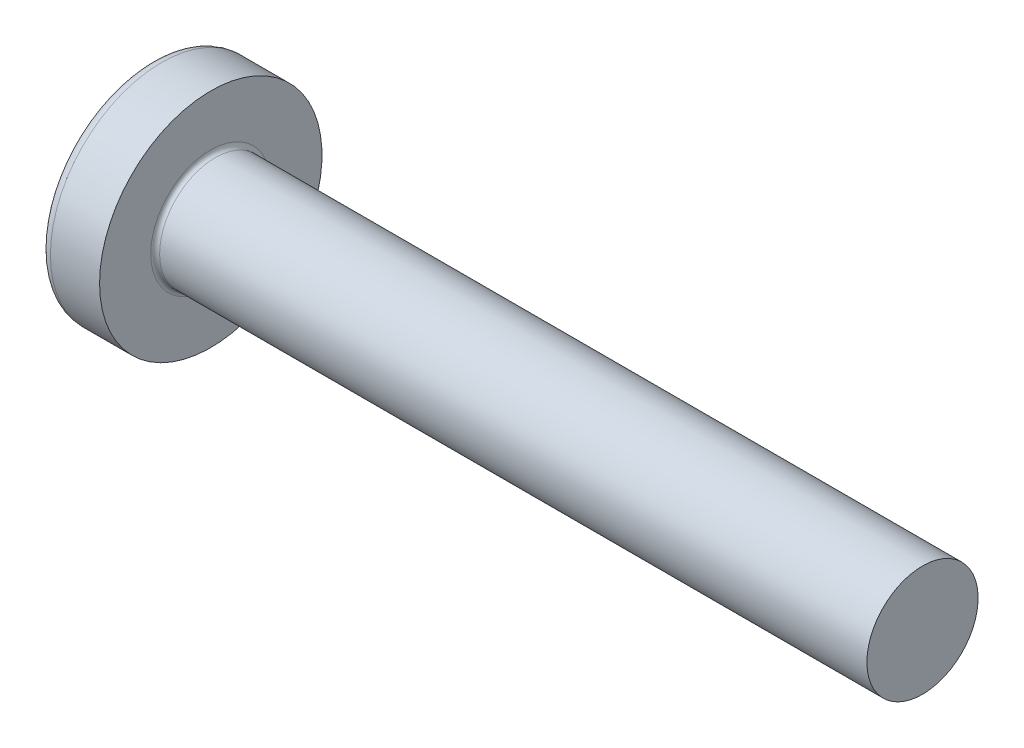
from build123d import *

# Parameters (mm, degrees)
FILLET1_R    = 0.1
RECPAT_COUNT = 2
RECPAT_ANGLE = 90


with BuildPart() as part:
    # BodySke → Base-Revolve (revolve)
    with BuildSketch(Plane.XY, mode=Mode.PRIVATE) as base_revolve_sk:
        with BuildLine():
            Line((2.1, 1.25), (2.1, 2.5))
            Line((2.1, 2.5), (0.99500416, 2.5))
            ThreePointArc((0.99500416, 2.5), (0.88781572, 2.474733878), (0.803195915, 2.404255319))
            ThreePointArc((0.803195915, 2.404255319), (0.206109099, 1.267435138), (0, 0))
            Line((0, 0), (18.1, 0))
            Line((18.1, 0), (18.1, 1.25))
            Line((18.1, 1.25), (2.1, 1.25))
        make_face()
    revolve(base_revolve_sk.sketch.rotate(Axis((0.99500416, 0, 0), (1, 0, 0)), 90), axis=Axis((0.99500416, 0, 0), (1, 0, 0)))

    # Fillet1
    fillet1_edges = [part.edges().sort_by_distance(p)[0] for p in [
        (2.1, 0, -1.25),
    ]]
    fillet(fillet1_edges, radius=FILLET1_R)

    # Sketch3 → Recess section 0
    with BuildSketch(Plane(origin=(0, 0, 0), x_dir=(0, 0, -1), z_dir=(1, 0, 0))):
        with BuildLine():
            Line((0.37, -1.3), (-0.37, -1.3))
            Line((-0.37, -1.3), (-0.37, 1.3))
            Line((-0.37, 1.3), (0.37, 1.3))
            Line((0.37, 1.3), (0.37, -1.3))
        make_face()
    # Sketch4 → Recess section 1
    with BuildSketch(Plane(origin=(1.5, 0, 0), x_dir=(0, 0, -1), z_dir=(1, 0, 0))):
        with BuildLine():
            Line((0.37, -0.552127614), (-0.37, -0.552127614))
            Line((-0.37, -0.552127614), (-0.37, 0.552127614))
            Line((-0.37, 0.552127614), (0.37, 0.552127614))
            Line((0.37, 0.552127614), (0.37, -0.552127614))
        make_face()
    recess = loft(mode=Mode.SUBTRACT)

    # RecPat: Recess ×2 about axis
    recpat_axis = Axis((0, 0, 0), (1, 0, 0))
    for i in range(1, RECPAT_COUNT):
        add(recess.rotate(recpat_axis, i * RECPAT_ANGLE / (RECPAT_COUNT - 1)), mode=Mode.SUBTRACT)

    # RecCorSke → RecessCore (revolve, cut)
    with BuildSketch(Plane.XY, mode=Mode.PRIVATE) as recesscore_sk:
        Polygon((0, 0), (0, 0.660890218), (1.5, 0.556), (1.680655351, 0), align=None)
    revolve(recesscore_sk.sketch.rotate(Axis((-3.175, 0, 0), (1, 0, 0)), 17.145865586), axis=Axis((-3.175, 0, 0), (1, 0, 0)), mode=Mode.SUBTRACT)


solid = part.part
